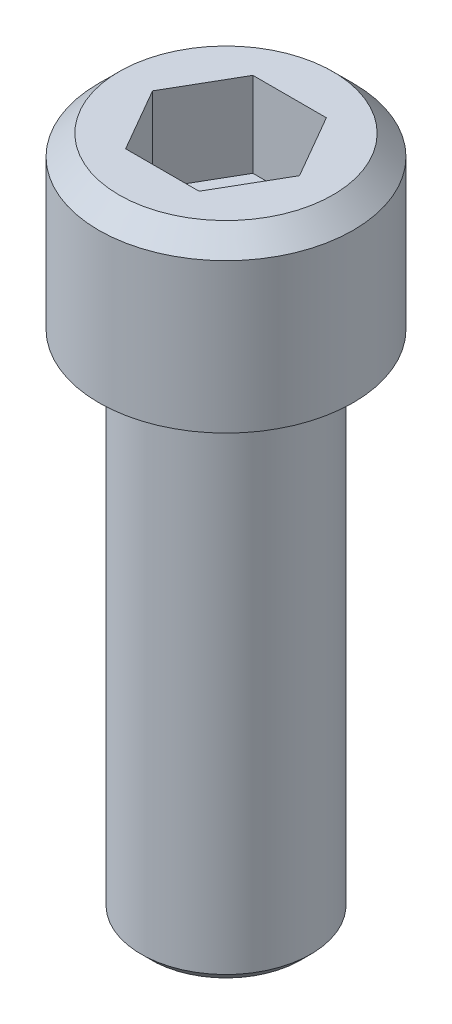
ISO-10303-21;
HEADER;
FILE_DESCRIPTION(('STEP AP214'),'2;1');
FILE_NAME('part.step','',(''),(''),'','','');
FILE_SCHEMA(('AUTOMOTIVE_DESIGN { 1 0 10303 214 1 1 1 1 }'));
ENDSEC;
DATA;
#1=APPLICATION_CONTEXT('core data for automotive mechanical design processes');
#2=APPLICATION_PROTOCOL_DEFINITION('international standard','automotive_design',2000,#1);
#3=PRODUCT_CONTEXT('',#1,'mechanical');
#4=PRODUCT('Part','Part','',(#3));
#5=PRODUCT_RELATED_PRODUCT_CATEGORY('part','',(#4));
#6=PRODUCT_DEFINITION_FORMATION('','',#4);
#7=PRODUCT_DEFINITION_CONTEXT('part definition',#1,'design');
#8=PRODUCT_DEFINITION('design','',#6,#7);
#9=PRODUCT_DEFINITION_SHAPE('','',#8);
#10=(LENGTH_UNIT() NAMED_UNIT(*) SI_UNIT(.MILLI.,.METRE.));
#11=(NAMED_UNIT(*) PLANE_ANGLE_UNIT() SI_UNIT($,.RADIAN.));
#12=(NAMED_UNIT(*) SI_UNIT($,.STERADIAN.) SOLID_ANGLE_UNIT());
#13=UNCERTAINTY_MEASURE_WITH_UNIT(LENGTH_MEASURE(1.E-05),#10,'distance_accuracy_value','');
#14=(GEOMETRIC_REPRESENTATION_CONTEXT(3) GLOBAL_UNCERTAINTY_ASSIGNED_CONTEXT((#13)) GLOBAL_UNIT_ASSIGNED_CONTEXT((#10,
#11,#12)) REPRESENTATION_CONTEXT('',''));
#15=CARTESIAN_POINT('',(0.,0.,0.));
#16=DIRECTION('',(0.,0.,1.));
#17=DIRECTION('',(1.,0.,0.));
#18=AXIS2_PLACEMENT_3D('',#15,#16,#17);
#19=CARTESIAN_POINT('',(0.,0.,0.));
#20=DIRECTION('',(0.,-1.,0.));
#21=DIRECTION('',(0.,0.,-1.));
#22=AXIS2_PLACEMENT_3D('',#19,#20,#21);
#23=CYLINDRICAL_SURFACE('',#22,9.525);
#24=CARTESIAN_POINT('',(0.,11.176,0.));
#25=DIRECTION('',(0.,1.,0.));
#26=DIRECTION('',(0.,0.,1.));
#27=AXIS2_PLACEMENT_3D('',#24,#25,#26);
#28=CIRCLE('',#27,9.525);
#29=CARTESIAN_POINT('',(0.,11.176,9.525));
#30=VERTEX_POINT('',#29);
#31=EDGE_CURVE('E137',#30,#30,#28,.F.);
#32=ORIENTED_EDGE('',*,*,#31,.T.);
#33=EDGE_LOOP('',(#32));
#34=FACE_BOUND('',#33,.T.);
#35=CARTESIAN_POINT('',(0.,0.,0.));
#36=DIRECTION('',(0.,-1.,0.));
#37=DIRECTION('',(0.,0.,-1.));
#38=AXIS2_PLACEMENT_3D('',#35,#36,#37);
#39=CIRCLE('',#38,9.525);
#40=CARTESIAN_POINT('',(0.,0.,-9.525));
#41=VERTEX_POINT('',#40);
#42=EDGE_CURVE('E125',#41,#41,#39,.T.);
#43=ORIENTED_EDGE('',*,*,#42,.F.);
#44=EDGE_LOOP('',(#43));
#45=FACE_BOUND('',#44,.T.);
#46=ADVANCED_FACE('F26',(#34,#45),#23,.T.);
#47=CARTESIAN_POINT('',(9.525,12.7,0.));
#48=DIRECTION('',(0.,1.,0.));
#49=DIRECTION('',(0.,0.,1.));
#50=AXIS2_PLACEMENT_3D('',#47,#48,#49);
#51=PLANE('',#50);
#52=CARTESIAN_POINT('',(0.,12.7,0.));
#53=DIRECTION('',(0.,1.,0.));
#54=DIRECTION('',(0.,0.,1.));
#55=AXIS2_PLACEMENT_3D('',#52,#53,#54);
#56=CIRCLE('',#55,8.00099999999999);
#57=CARTESIAN_POINT('',(0.,12.7,8.00099999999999));
#58=VERTEX_POINT('',#57);
#59=EDGE_CURVE('E140',#58,#58,#56,.T.);
#60=ORIENTED_EDGE('',*,*,#59,.T.);
#61=EDGE_LOOP('',(#60));
#62=FACE_BOUND('',#61,.T.);
#63=DIRECTION('',(1.,0.,0.));
#64=VECTOR('',#63,1.);
#65=CARTESIAN_POINT('',(-2.74963065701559,12.7,4.7625));
#66=LINE('',#65,#64);
#67=CARTESIAN_POINT('',(-2.74963065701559,12.7,4.7625));
#68=VERTEX_POINT('',#67);
#69=CARTESIAN_POINT('',(2.74963065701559,12.7,4.7625));
#70=VERTEX_POINT('',#69);
#71=EDGE_CURVE('E40',#68,#70,#66,.T.);
#72=ORIENTED_EDGE('',*,*,#71,.F.);
#73=DIRECTION('',(0.5,0.,0.866025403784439));
#74=VECTOR('',#73,1.);
#75=CARTESIAN_POINT('',(-5.49926131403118,12.7,0.));
#76=LINE('',#75,#74);
#77=CARTESIAN_POINT('',(-5.49926131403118,12.7,0.));
#78=VERTEX_POINT('',#77);
#79=EDGE_CURVE('E109',#78,#68,#76,.T.);
#80=ORIENTED_EDGE('',*,*,#79,.F.);
#81=DIRECTION('',(0.5,0.,-0.866025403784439));
#82=VECTOR('',#81,1.);
#83=CARTESIAN_POINT('',(-5.49926131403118,12.7,0.));
#84=LINE('',#83,#82);
#85=CARTESIAN_POINT('',(-2.74963065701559,12.7,-4.7625));
#86=VERTEX_POINT('',#85);
#87=EDGE_CURVE('E104',#78,#86,#84,.T.);
#88=ORIENTED_EDGE('',*,*,#87,.T.);
#89=DIRECTION('',(1.,0.,0.));
#90=VECTOR('',#89,1.);
#91=CARTESIAN_POINT('',(-2.74963065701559,12.7,-4.7625));
#92=LINE('',#91,#90);
#93=CARTESIAN_POINT('',(2.74963065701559,12.7,-4.7625));
#94=VERTEX_POINT('',#93);
#95=EDGE_CURVE('E102',#86,#94,#92,.T.);
#96=ORIENTED_EDGE('',*,*,#95,.T.);
#97=DIRECTION('',(-0.5,0.,-0.866025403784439));
#98=VECTOR('',#97,1.);
#99=CARTESIAN_POINT('',(5.49926131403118,12.7,0.));
#100=LINE('',#99,#98);
#101=CARTESIAN_POINT('',(5.49926131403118,12.7,0.));
#102=VERTEX_POINT('',#101);
#103=EDGE_CURVE('E85',#102,#94,#100,.T.);
#104=ORIENTED_EDGE('',*,*,#103,.F.);
#105=DIRECTION('',(-0.5,0.,0.866025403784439));
#106=VECTOR('',#105,1.);
#107=CARTESIAN_POINT('',(5.49926131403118,12.7,0.));
#108=LINE('',#107,#106);
#109=EDGE_CURVE('E95',#102,#70,#108,.T.);
#110=ORIENTED_EDGE('',*,*,#109,.T.);
#111=EDGE_LOOP('',(#72,#80,#88,#96,#104,#110));
#112=FACE_BOUND('',#111,.T.);
#113=ADVANCED_FACE('F99',(#62,#112),#51,.T.);
#114=CARTESIAN_POINT('',(0.,-38.1,0.));
#115=DIRECTION('',(0.,-1.,0.));
#116=DIRECTION('',(0.,0.,-1.));
#117=AXIS2_PLACEMENT_3D('',#114,#115,#116);
#118=PLANE('',#117);
#119=CARTESIAN_POINT('',(0.,-38.1,0.));
#120=DIRECTION('',(0.,-1.,0.));
#121=DIRECTION('',(0.,0.,-1.));
#122=AXIS2_PLACEMENT_3D('',#119,#120,#121);
#123=CIRCLE('',#122,5.58799999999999);
#124=CARTESIAN_POINT('',(0.,-38.1,-5.58799999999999));
#125=VERTEX_POINT('',#124);
#126=EDGE_CURVE('E33',#125,#125,#123,.T.);
#127=ORIENTED_EDGE('',*,*,#126,.T.);
#128=EDGE_LOOP('',(#127));
#129=FACE_BOUND('',#128,.T.);
#130=ADVANCED_FACE('F145',(#129),#118,.T.);
#131=CARTESIAN_POINT('',(0.,0.,0.));
#132=DIRECTION('',(0.,-1.,0.));
#133=DIRECTION('',(0.,0.,-1.));
#134=AXIS2_PLACEMENT_3D('',#131,#132,#133);
#135=CYLINDRICAL_SURFACE('',#134,6.35);
#136=CARTESIAN_POINT('',(0.,-37.338,0.));
#137=DIRECTION('',(0.,-1.,0.));
#138=DIRECTION('',(0.,0.,-1.));
#139=AXIS2_PLACEMENT_3D('',#136,#137,#138);
#140=CIRCLE('',#139,6.35);
#141=CARTESIAN_POINT('',(0.,-37.338,-6.35));
#142=VERTEX_POINT('',#141);
#143=EDGE_CURVE('E11',#142,#142,#140,.F.);
#144=ORIENTED_EDGE('',*,*,#143,.T.);
#145=EDGE_LOOP('',(#144));
#146=FACE_BOUND('',#145,.T.);
#147=CARTESIAN_POINT('',(0.,0.,0.));
#148=DIRECTION('',(0.,-1.,0.));
#149=DIRECTION('',(0.,0.,-1.));
#150=AXIS2_PLACEMENT_3D('',#147,#148,#149);
#151=CIRCLE('',#150,6.35);
#152=CARTESIAN_POINT('',(0.,0.,-6.35));
#153=VERTEX_POINT('',#152);
#154=EDGE_CURVE('E134',#153,#153,#151,.T.);
#155=ORIENTED_EDGE('',*,*,#154,.T.);
#156=EDGE_LOOP('',(#155));
#157=FACE_BOUND('',#156,.T.);
#158=ADVANCED_FACE('F175',(#146,#157),#135,.T.);
#159=CARTESIAN_POINT('',(6.35,0.,0.));
#160=DIRECTION('',(0.,-1.,0.));
#161=DIRECTION('',(0.,0.,-1.));
#162=AXIS2_PLACEMENT_3D('',#159,#160,#161);
#163=PLANE('',#162);
#164=ORIENTED_EDGE('',*,*,#42,.T.);
#165=EDGE_LOOP('',(#164));
#166=FACE_BOUND('',#165,.T.);
#167=ORIENTED_EDGE('',*,*,#154,.F.);
#168=EDGE_LOOP('',(#167));
#169=FACE_BOUND('',#168,.T.);
#170=ADVANCED_FACE('F171',(#166,#169),#163,.T.);
#171=CARTESIAN_POINT('',(-2.74963065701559,6.35,4.7625));
#172=DIRECTION('',(0.,0.,1.));
#173=DIRECTION('',(1.,0.,0.));
#174=AXIS2_PLACEMENT_3D('',#171,#172,#173);
#175=PLANE('',#174);
#176=ORIENTED_EDGE('',*,*,#71,.T.);
#177=DIRECTION('',(0.,1.,0.));
#178=VECTOR('',#177,1.);
#179=CARTESIAN_POINT('',(2.74963065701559,6.35,4.7625));
#180=LINE('',#179,#178);
#181=CARTESIAN_POINT('',(2.74963065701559,6.35,4.7625));
#182=VERTEX_POINT('',#181);
#183=EDGE_CURVE('E92',#182,#70,#180,.T.);
#184=ORIENTED_EDGE('',*,*,#183,.F.);
#185=DIRECTION('',(1.,0.,0.));
#186=VECTOR('',#185,1.);
#187=CARTESIAN_POINT('',(-2.74963065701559,6.35,4.7625));
#188=LINE('',#187,#186);
#189=CARTESIAN_POINT('',(-2.74963065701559,6.35,4.7625));
#190=VERTEX_POINT('',#189);
#191=EDGE_CURVE('E111',#190,#182,#188,.T.);
#192=ORIENTED_EDGE('',*,*,#191,.F.);
#193=DIRECTION('',(0.,1.,0.));
#194=VECTOR('',#193,1.);
#195=CARTESIAN_POINT('',(-2.74963065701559,6.35,4.7625));
#196=LINE('',#195,#194);
#197=EDGE_CURVE('E47',#190,#68,#196,.T.);
#198=ORIENTED_EDGE('',*,*,#197,.T.);
#199=EDGE_LOOP('',(#176,#184,#192,#198));
#200=FACE_BOUND('',#199,.T.);
#201=ADVANCED_FACE('F174',(#200),#175,.F.);
#202=CARTESIAN_POINT('',(-5.49926131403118,6.35,0.));
#203=DIRECTION('',(-0.866025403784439,0.,0.5));
#204=DIRECTION('',(0.5,0.,0.866025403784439));
#205=AXIS2_PLACEMENT_3D('',#202,#203,#204);
#206=PLANE('',#205);
#207=ORIENTED_EDGE('',*,*,#79,.T.);
#208=ORIENTED_EDGE('',*,*,#197,.F.);
#209=DIRECTION('',(0.5,0.,0.866025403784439));
#210=VECTOR('',#209,1.);
#211=CARTESIAN_POINT('',(-5.49926131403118,6.35,0.));
#212=LINE('',#211,#210);
#213=CARTESIAN_POINT('',(-5.49926131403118,6.35,0.));
#214=VERTEX_POINT('',#213);
#215=EDGE_CURVE('E121',#214,#190,#212,.T.);
#216=ORIENTED_EDGE('',*,*,#215,.F.);
#217=DIRECTION('',(0.,1.,0.));
#218=VECTOR('',#217,1.);
#219=CARTESIAN_POINT('',(-5.49926131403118,6.35,0.));
#220=LINE('',#219,#218);
#221=EDGE_CURVE('E126',#214,#78,#220,.T.);
#222=ORIENTED_EDGE('',*,*,#221,.T.);
#223=EDGE_LOOP('',(#207,#208,#216,#222));
#224=FACE_BOUND('',#223,.T.);
#225=ADVANCED_FACE('F188',(#224),#206,.F.);
#226=CARTESIAN_POINT('',(-5.49926131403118,6.35,0.));
#227=DIRECTION('',(0.866025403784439,0.,0.5));
#228=DIRECTION('',(0.5,0.,-0.866025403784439));
#229=AXIS2_PLACEMENT_3D('',#226,#227,#228);
#230=PLANE('',#229);
#231=ORIENTED_EDGE('',*,*,#87,.F.);
#232=ORIENTED_EDGE('',*,*,#221,.F.);
#233=DIRECTION('',(0.5,0.,-0.866025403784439));
#234=VECTOR('',#233,1.);
#235=CARTESIAN_POINT('',(-5.49926131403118,6.35,0.));
#236=LINE('',#235,#234);
#237=CARTESIAN_POINT('',(-2.74963065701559,6.35,-4.7625));
#238=VERTEX_POINT('',#237);
#239=EDGE_CURVE('E119',#214,#238,#236,.T.);
#240=ORIENTED_EDGE('',*,*,#239,.T.);
#241=DIRECTION('',(0.,1.,0.));
#242=VECTOR('',#241,1.);
#243=CARTESIAN_POINT('',(-2.74963065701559,6.35,-4.7625));
#244=LINE('',#243,#242);
#245=EDGE_CURVE('E128',#238,#86,#244,.T.);
#246=ORIENTED_EDGE('',*,*,#245,.T.);
#247=EDGE_LOOP('',(#231,#232,#240,#246));
#248=FACE_BOUND('',#247,.T.);
#249=ADVANCED_FACE('F196',(#248),#230,.T.);
#250=CARTESIAN_POINT('',(-2.74963065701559,6.35,-4.7625));
#251=DIRECTION('',(0.,0.,1.));
#252=DIRECTION('',(1.,0.,0.));
#253=AXIS2_PLACEMENT_3D('',#250,#251,#252);
#254=PLANE('',#253);
#255=ORIENTED_EDGE('',*,*,#95,.F.);
#256=ORIENTED_EDGE('',*,*,#245,.F.);
#257=DIRECTION('',(1.,0.,0.));
#258=VECTOR('',#257,1.);
#259=CARTESIAN_POINT('',(-2.74963065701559,6.35,-4.7625));
#260=LINE('',#259,#258);
#261=CARTESIAN_POINT('',(2.74963065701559,6.35,-4.7625));
#262=VERTEX_POINT('',#261);
#263=EDGE_CURVE('E117',#238,#262,#260,.T.);
#264=ORIENTED_EDGE('',*,*,#263,.T.);
#265=DIRECTION('',(0.,1.,0.));
#266=VECTOR('',#265,1.);
#267=CARTESIAN_POINT('',(2.74963065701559,6.35,-4.7625));
#268=LINE('',#267,#266);
#269=EDGE_CURVE('E91',#262,#94,#268,.T.);
#270=ORIENTED_EDGE('',*,*,#269,.T.);
#271=EDGE_LOOP('',(#255,#256,#264,#270));
#272=FACE_BOUND('',#271,.T.);
#273=ADVANCED_FACE('F193',(#272),#254,.T.);
#274=CARTESIAN_POINT('',(5.49926131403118,6.35,0.));
#275=DIRECTION('',(0.866025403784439,0.,-0.5));
#276=DIRECTION('',(-0.5,0.,-0.866025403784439));
#277=AXIS2_PLACEMENT_3D('',#274,#275,#276);
#278=PLANE('',#277);
#279=ORIENTED_EDGE('',*,*,#103,.T.);
#280=ORIENTED_EDGE('',*,*,#269,.F.);
#281=DIRECTION('',(-0.5,0.,-0.866025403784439));
#282=VECTOR('',#281,1.);
#283=CARTESIAN_POINT('',(5.49926131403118,6.35,0.));
#284=LINE('',#283,#282);
#285=CARTESIAN_POINT('',(5.49926131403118,6.35,0.));
#286=VERTEX_POINT('',#285);
#287=EDGE_CURVE('E88',#286,#262,#284,.T.);
#288=ORIENTED_EDGE('',*,*,#287,.F.);
#289=DIRECTION('',(0.,1.,0.));
#290=VECTOR('',#289,1.);
#291=CARTESIAN_POINT('',(5.49926131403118,6.35,0.));
#292=LINE('',#291,#290);
#293=EDGE_CURVE('E80',#286,#102,#292,.T.);
#294=ORIENTED_EDGE('',*,*,#293,.T.);
#295=EDGE_LOOP('',(#279,#280,#288,#294));
#296=FACE_BOUND('',#295,.T.);
#297=ADVANCED_FACE('F82',(#296),#278,.F.);
#298=CARTESIAN_POINT('',(5.49926131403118,6.35,0.));
#299=DIRECTION('',(-0.866025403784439,0.,-0.5));
#300=DIRECTION('',(-0.5,0.,0.866025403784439));
#301=AXIS2_PLACEMENT_3D('',#298,#299,#300);
#302=PLANE('',#301);
#303=ORIENTED_EDGE('',*,*,#109,.F.);
#304=ORIENTED_EDGE('',*,*,#293,.F.);
#305=DIRECTION('',(-0.5,0.,0.866025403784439));
#306=VECTOR('',#305,1.);
#307=CARTESIAN_POINT('',(5.49926131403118,6.35,0.));
#308=LINE('',#307,#306);
#309=EDGE_CURVE('E114',#286,#182,#308,.T.);
#310=ORIENTED_EDGE('',*,*,#309,.T.);
#311=ORIENTED_EDGE('',*,*,#183,.T.);
#312=EDGE_LOOP('',(#303,#304,#310,#311));
#313=FACE_BOUND('',#312,.T.);
#314=ADVANCED_FACE('F96',(#313),#302,.T.);
#315=CARTESIAN_POINT('',(2.74963065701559,6.35,4.7625));
#316=DIRECTION('',(0.,-1.,0.));
#317=DIRECTION('',(0.,0.,-1.));
#318=AXIS2_PLACEMENT_3D('',#315,#316,#317);
#319=PLANE('',#318);
#320=ORIENTED_EDGE('',*,*,#191,.T.);
#321=ORIENTED_EDGE('',*,*,#309,.F.);
#322=ORIENTED_EDGE('',*,*,#287,.T.);
#323=ORIENTED_EDGE('',*,*,#263,.F.);
#324=ORIENTED_EDGE('',*,*,#239,.F.);
#325=ORIENTED_EDGE('',*,*,#215,.T.);
#326=EDGE_LOOP('',(#320,#321,#322,#323,#324,#325));
#327=FACE_BOUND('',#326,.T.);
#328=ADVANCED_FACE('F156',(#327),#319,.F.);
#329=CARTESIAN_POINT('',(0.,11.176,0.));
#330=DIRECTION('',(0.,-1.,0.));
#331=DIRECTION('',(0.,0.,-1.));
#332=AXIS2_PLACEMENT_3D('',#329,#330,#331);
#333=CONICAL_SURFACE('',#332,9.525,0.785398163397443);
#334=ORIENTED_EDGE('',*,*,#59,.F.);
#335=EDGE_LOOP('',(#334));
#336=FACE_BOUND('',#335,.T.);
#337=ORIENTED_EDGE('',*,*,#31,.F.);
#338=EDGE_LOOP('',(#337));
#339=FACE_BOUND('',#338,.T.);
#340=ADVANCED_FACE('F149',(#336,#339),#333,.T.);
#341=CARTESIAN_POINT('',(0.,-38.1,0.));
#342=DIRECTION('',(0.,1.,0.));
#343=DIRECTION('',(0.,0.,1.));
#344=AXIS2_PLACEMENT_3D('',#341,#342,#343);
#345=CONICAL_SURFACE('',#344,5.58799999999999,0.785398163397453);
#346=ORIENTED_EDGE('',*,*,#143,.F.);
#347=EDGE_LOOP('',(#346));
#348=FACE_BOUND('',#347,.T.);
#349=ORIENTED_EDGE('',*,*,#126,.F.);
#350=EDGE_LOOP('',(#349));
#351=FACE_BOUND('',#350,.T.);
#352=ADVANCED_FACE('F147',(#348,#351),#345,.T.);
#353=CLOSED_SHELL('',(#46,#113,#130,#158,#170,#201,#225,#249,#273,#297,#314,#328,#340,#352));
#354=MANIFOLD_SOLID_BREP('B2',#353);
#355=ADVANCED_BREP_SHAPE_REPRESENTATION('',(#18,#354),#14);
#356=SHAPE_DEFINITION_REPRESENTATION(#9,#355);
ENDSEC;
END-ISO-10303-21;
